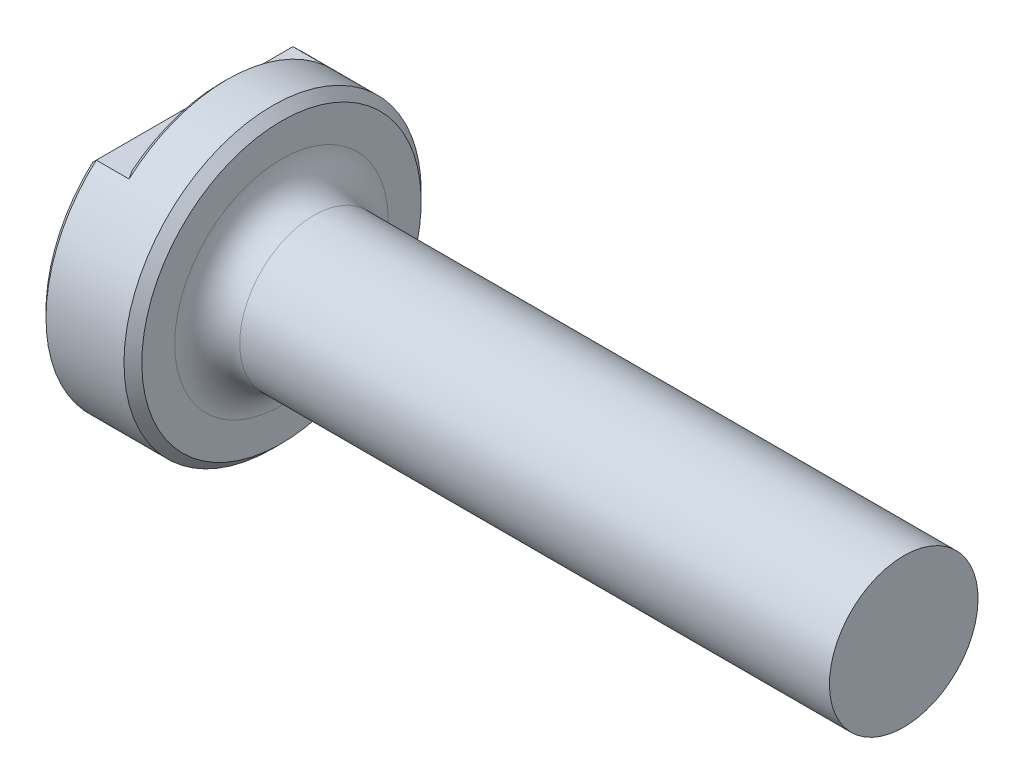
from build123d import *

# Parameters (mm, degrees)
SKETCH1_R           = 25.4
BOSS_EXTRUDE1_DEPTH = 61.11875
SKETCH3_W           = 50.8
SKETCH3_H           = 6.35
CUT_EXTRUDE1_DEPTH  = 5.588
SKETCH5_W           = 106.3625
SKETCH5_H           = 12.7
FILLET1_R           = 5.55625
CHAMFER1_SIZE       = 1.524
CHAMFER2_SIZE       = 1.016


with BuildPart() as part:
    # Sketch1 → Boss-Extrude1 (new, symmetric)
    with BuildSketch(Plane(origin=(0, 0, 0), x_dir=(0, 0, -1), z_dir=(1, 0, 0))):
        Circle(SKETCH1_R)
    extrude(amount=BOSS_EXTRUDE1_DEPTH, both=True)

    # Sketch3 → Cut-Extrude1 (cut)
    with BuildSketch(Plane.ZY.offset(61.11875)):
        with Locations((0, 22.225)):
            Rectangle(SKETCH3_W, SKETCH3_H)
    extrude(amount=-CUT_EXTRUDE1_DEPTH, mode=Mode.SUBTRACT)

    # Sketch5 → Cut-Revolve1 (revolve, cut)
    with BuildSketch(Plane.XY, mode=Mode.PRIVATE) as cut_revolve1_sk:
        with Locations((7.9375, -19.05)):
            Rectangle(SKETCH5_W, SKETCH5_H)
    revolve(cut_revolve1_sk.sketch.rotate(Axis((61.11875, 0, 0), (-1, 0, 0)), 138.590377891), axis=Axis((61.11875, 0, 0), (-1, 0, 0)), mode=Mode.SUBTRACT)

    # Sketch6 → Cut-Revolve2 (revolve, cut)
    with BuildSketch(Plane.XY):
        with BuildLine():
            Line((-56.49595, 0), (-61.11875, 0))
            Line((-61.11875, 0), (-61.11875, 12.440192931))
            ThreePointArc((-61.11875, 12.440192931), (-57.689009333, 6.635674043), (-56.49595, 0))
        make_face()
    revolve(axis=Axis((61.11875, 0, 0), (-1, 0, 0)), mode=Mode.SUBTRACT)

    # Fillet1
    fillet1_edges = [part.edges().sort_by_distance(p)[0] for p in [
        (-45.24375, -9.525, -8.400260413),
    ]]
    fillet(fillet1_edges, radius=FILLET1_R)

    # Chamfer1
    chamfer1_edges = [part.edges().sort_by_distance(p)[0] for p in [
        (-45.24375, 0, 25.4),
    ]]
    chamfer(chamfer1_edges, length=CHAMFER1_SIZE)

    # Chamfer2
    chamfer2_edges = [part.edges().sort_by_distance(p)[0] for p in [
        (-61.11875, -23.150520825, 10.450520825),
        (-61.11875, 19.05, 0),
        (-55.53075, 25.4, 0),
    ]]
    chamfer(chamfer2_edges, length=CHAMFER2_SIZE)


solid = part.part
